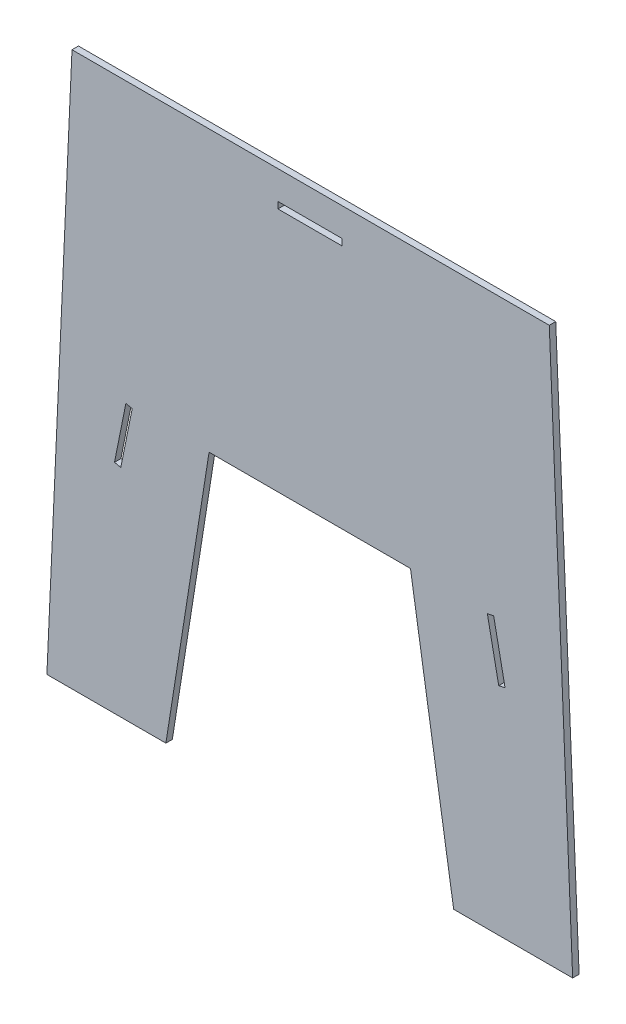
ISO-10303-21;
HEADER;
FILE_DESCRIPTION(('STEP AP214'),'2;1');
FILE_NAME('part.step','',(''),(''),'','','');
FILE_SCHEMA(('AUTOMOTIVE_DESIGN { 1 0 10303 214 1 1 1 1 }'));
ENDSEC;
DATA;
#1=APPLICATION_CONTEXT('core data for automotive mechanical design processes');
#2=APPLICATION_PROTOCOL_DEFINITION('international standard','automotive_design',2000,#1);
#3=PRODUCT_CONTEXT('',#1,'mechanical');
#4=PRODUCT('Part','Part','',(#3));
#5=PRODUCT_RELATED_PRODUCT_CATEGORY('part','',(#4));
#6=PRODUCT_DEFINITION_FORMATION('','',#4);
#7=PRODUCT_DEFINITION_CONTEXT('part definition',#1,'design');
#8=PRODUCT_DEFINITION('design','',#6,#7);
#9=PRODUCT_DEFINITION_SHAPE('','',#8);
#10=(LENGTH_UNIT() NAMED_UNIT(*) SI_UNIT(.MILLI.,.METRE.));
#11=(NAMED_UNIT(*) PLANE_ANGLE_UNIT() SI_UNIT($,.RADIAN.));
#12=(NAMED_UNIT(*) SI_UNIT($,.STERADIAN.) SOLID_ANGLE_UNIT());
#13=UNCERTAINTY_MEASURE_WITH_UNIT(LENGTH_MEASURE(1.E-05),#10,'distance_accuracy_value','');
#14=(GEOMETRIC_REPRESENTATION_CONTEXT(3) GLOBAL_UNCERTAINTY_ASSIGNED_CONTEXT((#13)) GLOBAL_UNIT_ASSIGNED_CONTEXT((#10,
#11,#12)) REPRESENTATION_CONTEXT('',''));
#15=CARTESIAN_POINT('',(0.,0.,0.));
#16=DIRECTION('',(0.,0.,1.));
#17=DIRECTION('',(1.,0.,0.));
#18=AXIS2_PLACEMENT_3D('',#15,#16,#17);
#19=CARTESIAN_POINT('',(0.,0.,1.524));
#20=DIRECTION('',(0.,0.,-1.));
#21=DIRECTION('',(-1.,0.,0.));
#22=AXIS2_PLACEMENT_3D('',#19,#20,#21);
#23=PLANE('',#22);
#24=DIRECTION('',(-0.197028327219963,0.980397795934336,0.));
#25=VECTOR('',#24,1.);
#26=CARTESIAN_POINT('',(43.3374292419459,52.9882041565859,1.524));
#27=LINE('',#26,#25);
#28=CARTESIAN_POINT('',(46.0269135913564,39.6055369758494,1.524));
#29=VERTEX_POINT('',#28);
#30=CARTESIAN_POINT('',(43.3374292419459,52.9882041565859,1.524));
#31=VERTEX_POINT('',#30);
#32=EDGE_CURVE('E207',#29,#31,#27,.T.);
#33=ORIENTED_EDGE('',*,*,#32,.F.);
#34=DIRECTION('',(0.980397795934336,0.197028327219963,0.));
#35=VECTOR('',#34,1.);
#36=CARTESIAN_POINT('',(46.0269135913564,39.6055369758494,1.524));
#37=LINE('',#36,#35);
#38=CARTESIAN_POINT('',(44.5327873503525,39.3052658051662,1.524));
#39=VERTEX_POINT('',#38);
#40=EDGE_CURVE('E215',#39,#29,#37,.T.);
#41=ORIENTED_EDGE('',*,*,#40,.F.);
#42=DIRECTION('',(0.197028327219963,-0.980397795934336,0.));
#43=VECTOR('',#42,1.);
#44=CARTESIAN_POINT('',(41.843303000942,52.6879329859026,1.524));
#45=LINE('',#44,#43);
#46=CARTESIAN_POINT('',(41.843303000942,52.6879329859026,1.524));
#47=VERTEX_POINT('',#46);
#48=EDGE_CURVE('E212',#47,#39,#45,.T.);
#49=ORIENTED_EDGE('',*,*,#48,.F.);
#50=DIRECTION('',(-0.980397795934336,-0.197028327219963,0.));
#51=VECTOR('',#50,1.);
#52=CARTESIAN_POINT('',(43.3374292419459,52.9882041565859,1.524));
#53=LINE('',#52,#51);
#54=EDGE_CURVE('E209',#31,#47,#53,.T.);
#55=ORIENTED_EDGE('',*,*,#54,.F.);
#56=EDGE_LOOP('',(#33,#41,#49,#55));
#57=FACE_BOUND('',#56,.T.);
#58=DIRECTION('',(1.,0.,0.));
#59=VECTOR('',#58,1.);
#60=CARTESIAN_POINT('',(-62.1420824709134,-11.745780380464,1.524));
#61=LINE('',#60,#59);
#62=CARTESIAN_POINT('',(-62.1420824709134,-11.745780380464,1.524));
#63=VERTEX_POINT('',#62);
#64=CARTESIAN_POINT('',(-34.0484267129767,-11.745780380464,1.524));
#65=VERTEX_POINT('',#64);
#66=EDGE_CURVE('E269',#63,#65,#61,.T.);
#67=ORIENTED_EDGE('',*,*,#66,.T.);
#68=DIRECTION('',(0.155946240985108,0.987765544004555,0.));
#69=VECTOR('',#68,1.);
#70=CARTESIAN_POINT('',(-23.8520713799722,52.8380685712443,1.524));
#71=LINE('',#70,#69);
#72=CARTESIAN_POINT('',(-23.8520713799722,52.8380685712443,1.524));
#73=VERTEX_POINT('',#72);
#74=EDGE_CURVE('E272',#65,#73,#71,.T.);
#75=ORIENTED_EDGE('',*,*,#74,.T.);
#76=DIRECTION('',(1.,0.,0.));
#77=VECTOR('',#76,1.);
#78=CARTESIAN_POINT('',(-23.8520713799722,52.8380685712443,1.524));
#79=LINE('',#78,#77);
#80=CARTESIAN_POINT('',(23.6958867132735,52.8380685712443,1.524));
#81=VERTEX_POINT('',#80);
#82=EDGE_CURVE('E275',#73,#81,#79,.T.);
#83=ORIENTED_EDGE('',*,*,#82,.T.);
#84=DIRECTION('',(0.155946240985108,-0.987765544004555,0.));
#85=VECTOR('',#84,1.);
#86=CARTESIAN_POINT('',(23.6958867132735,52.8380685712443,1.524));
#87=LINE('',#86,#85);
#88=CARTESIAN_POINT('',(33.8922420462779,-11.745780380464,1.524));
#89=VERTEX_POINT('',#88);
#90=EDGE_CURVE('E277',#81,#89,#87,.T.);
#91=ORIENTED_EDGE('',*,*,#90,.T.);
#92=DIRECTION('',(1.,0.,0.));
#93=VECTOR('',#92,1.);
#94=CARTESIAN_POINT('',(61.9858978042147,-11.745780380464,1.524));
#95=LINE('',#94,#93);
#96=CARTESIAN_POINT('',(61.9858978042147,-11.745780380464,1.524));
#97=VERTEX_POINT('',#96);
#98=EDGE_CURVE('E279',#89,#97,#95,.T.);
#99=ORIENTED_EDGE('',*,*,#98,.T.);
#100=DIRECTION('',(-0.0421941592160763,0.999109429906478,0.));
#101=VECTOR('',#100,1.);
#102=CARTESIAN_POINT('',(56.4665495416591,118.946073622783,1.524));
#103=LINE('',#102,#101);
#104=CARTESIAN_POINT('',(56.4665495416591,118.946073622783,1.524));
#105=VERTEX_POINT('',#104);
#106=EDGE_CURVE('E281',#97,#105,#103,.T.);
#107=ORIENTED_EDGE('',*,*,#106,.T.);
#108=DIRECTION('',(-1.,0.,0.));
#109=VECTOR('',#108,1.);
#110=CARTESIAN_POINT('',(-56.2129587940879,118.946073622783,1.524));
#111=LINE('',#110,#109);
#112=CARTESIAN_POINT('',(-56.2129587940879,118.946073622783,1.524));
#113=VERTEX_POINT('',#112);
#114=EDGE_CURVE('E283',#105,#113,#111,.T.);
#115=ORIENTED_EDGE('',*,*,#114,.T.);
#116=DIRECTION('',(-0.0453205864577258,-0.998972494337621,0.));
#117=VECTOR('',#116,1.);
#118=CARTESIAN_POINT('',(-62.1420824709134,-11.745780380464,1.524));
#119=LINE('',#118,#117);
#120=EDGE_CURVE('E285',#113,#63,#119,.T.);
#121=ORIENTED_EDGE('',*,*,#120,.T.);
#122=EDGE_LOOP('',(#67,#75,#83,#91,#99,#107,#115,#121));
#123=FACE_BOUND('',#122,.T.);
#124=DIRECTION('',(0.,1.,0.));
#125=VECTOR('',#124,1.);
#126=CARTESIAN_POINT('',(7.56016827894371,110.706807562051,1.524));
#127=LINE('',#126,#125);
#128=CARTESIAN_POINT('',(7.56016827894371,110.706807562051,1.524));
#129=VERTEX_POINT('',#128);
#130=CARTESIAN_POINT('',(7.56016827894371,112.230807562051,1.524));
#131=VERTEX_POINT('',#130);
#132=EDGE_CURVE('E238',#129,#131,#127,.T.);
#133=ORIENTED_EDGE('',*,*,#132,.F.);
#134=DIRECTION('',(1.,0.,0.));
#135=VECTOR('',#134,1.);
#136=CARTESIAN_POINT('',(-7.59699248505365,110.706807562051,1.524));
#137=LINE('',#136,#135);
#138=CARTESIAN_POINT('',(-7.59699248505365,110.706807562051,1.524));
#139=VERTEX_POINT('',#138);
#140=EDGE_CURVE('E246',#139,#129,#137,.T.);
#141=ORIENTED_EDGE('',*,*,#140,.F.);
#142=DIRECTION('',(0.,-1.,0.));
#143=VECTOR('',#142,1.);
#144=CARTESIAN_POINT('',(-7.59699248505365,110.706807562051,1.524));
#145=LINE('',#144,#143);
#146=CARTESIAN_POINT('',(-7.59699248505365,112.230807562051,1.524));
#147=VERTEX_POINT('',#146);
#148=EDGE_CURVE('E243',#147,#139,#145,.T.);
#149=ORIENTED_EDGE('',*,*,#148,.F.);
#150=DIRECTION('',(-1.,0.,0.));
#151=VECTOR('',#150,1.);
#152=CARTESIAN_POINT('',(-7.59699248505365,112.230807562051,1.524));
#153=LINE('',#152,#151);
#154=EDGE_CURVE('E240',#131,#147,#153,.T.);
#155=ORIENTED_EDGE('',*,*,#154,.F.);
#156=EDGE_LOOP('',(#133,#141,#149,#155));
#157=FACE_BOUND('',#156,.T.);
#158=DIRECTION('',(-0.980397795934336,0.197028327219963,0.));
#159=VECTOR('',#158,1.);
#160=CARTESIAN_POINT('',(-43.4936139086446,52.9882041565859,1.524));
#161=LINE('',#160,#159);
#162=CARTESIAN_POINT('',(-41.9994876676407,52.6879329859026,1.524));
#163=VERTEX_POINT('',#162);
#164=CARTESIAN_POINT('',(-43.4936139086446,52.9882041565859,1.524));
#165=VERTEX_POINT('',#164);
#166=EDGE_CURVE('E171',#163,#165,#161,.T.);
#167=ORIENTED_EDGE('',*,*,#166,.F.);
#168=DIRECTION('',(0.197028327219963,0.980397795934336,0.));
#169=VECTOR('',#168,1.);
#170=CARTESIAN_POINT('',(-41.9994876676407,52.6879329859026,1.524));
#171=LINE('',#170,#169);
#172=CARTESIAN_POINT('',(-44.6889720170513,39.3052658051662,1.524));
#173=VERTEX_POINT('',#172);
#174=EDGE_CURVE('E193',#173,#163,#171,.T.);
#175=ORIENTED_EDGE('',*,*,#174,.F.);
#176=DIRECTION('',(0.980397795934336,-0.197028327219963,0.));
#177=VECTOR('',#176,1.);
#178=CARTESIAN_POINT('',(-46.1830982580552,39.6055369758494,1.524));
#179=LINE('',#178,#177);
#180=CARTESIAN_POINT('',(-46.1830982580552,39.6055369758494,1.524));
#181=VERTEX_POINT('',#180);
#182=EDGE_CURVE('E191',#181,#173,#179,.T.);
#183=ORIENTED_EDGE('',*,*,#182,.F.);
#184=DIRECTION('',(-0.197028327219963,-0.980397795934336,0.));
#185=VECTOR('',#184,1.);
#186=CARTESIAN_POINT('',(-43.4936139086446,52.9882041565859,1.524));
#187=LINE('',#186,#185);
#188=EDGE_CURVE('E179',#165,#181,#187,.T.);
#189=ORIENTED_EDGE('',*,*,#188,.F.);
#190=EDGE_LOOP('',(#167,#175,#183,#189));
#191=FACE_BOUND('',#190,.T.);
#192=ADVANCED_FACE('F34',(#57,#123,#157,#191),#23,.F.);
#193=CARTESIAN_POINT('',(0.,0.,0.));
#194=DIRECTION('',(0.,0.,-1.));
#195=DIRECTION('',(-1.,0.,0.));
#196=AXIS2_PLACEMENT_3D('',#193,#194,#195);
#197=PLANE('',#196);
#198=DIRECTION('',(0.980397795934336,0.197028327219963,0.));
#199=VECTOR('',#198,1.);
#200=CARTESIAN_POINT('',(46.0269135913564,39.6055369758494,0.));
#201=LINE('',#200,#199);
#202=CARTESIAN_POINT('',(44.5327873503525,39.3052658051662,0.));
#203=VERTEX_POINT('',#202);
#204=CARTESIAN_POINT('',(46.0269135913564,39.6055369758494,0.));
#205=VERTEX_POINT('',#204);
#206=EDGE_CURVE('E210',#203,#205,#201,.T.);
#207=ORIENTED_EDGE('',*,*,#206,.T.);
#208=DIRECTION('',(-0.197028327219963,0.980397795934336,0.));
#209=VECTOR('',#208,1.);
#210=CARTESIAN_POINT('',(43.3374292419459,52.9882041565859,0.));
#211=LINE('',#210,#209);
#212=CARTESIAN_POINT('',(43.3374292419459,52.9882041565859,0.));
#213=VERTEX_POINT('',#212);
#214=EDGE_CURVE('E187',#205,#213,#211,.T.);
#215=ORIENTED_EDGE('',*,*,#214,.T.);
#216=DIRECTION('',(-0.980397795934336,-0.197028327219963,0.));
#217=VECTOR('',#216,1.);
#218=CARTESIAN_POINT('',(43.3374292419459,52.9882041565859,0.));
#219=LINE('',#218,#217);
#220=CARTESIAN_POINT('',(41.843303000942,52.6879329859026,0.));
#221=VERTEX_POINT('',#220);
#222=EDGE_CURVE('E220',#213,#221,#219,.T.);
#223=ORIENTED_EDGE('',*,*,#222,.T.);
#224=DIRECTION('',(0.197028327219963,-0.980397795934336,0.));
#225=VECTOR('',#224,1.);
#226=CARTESIAN_POINT('',(41.843303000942,52.6879329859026,0.));
#227=LINE('',#226,#225);
#228=EDGE_CURVE('E223',#221,#203,#227,.T.);
#229=ORIENTED_EDGE('',*,*,#228,.T.);
#230=EDGE_LOOP('',(#207,#215,#223,#229));
#231=FACE_BOUND('',#230,.T.);
#232=DIRECTION('',(1.,0.,0.));
#233=VECTOR('',#232,1.);
#234=CARTESIAN_POINT('',(-62.1420824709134,-11.745780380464,0.));
#235=LINE('',#234,#233);
#236=CARTESIAN_POINT('',(-62.1420824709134,-11.745780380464,0.));
#237=VERTEX_POINT('',#236);
#238=CARTESIAN_POINT('',(-34.0484267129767,-11.745780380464,0.));
#239=VERTEX_POINT('',#238);
#240=EDGE_CURVE('E268',#237,#239,#235,.T.);
#241=ORIENTED_EDGE('',*,*,#240,.F.);
#242=DIRECTION('',(-0.0453205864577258,-0.998972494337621,0.));
#243=VECTOR('',#242,1.);
#244=CARTESIAN_POINT('',(-62.1420824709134,-11.745780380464,0.));
#245=LINE('',#244,#243);
#246=CARTESIAN_POINT('',(-56.2129587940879,118.946073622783,0.));
#247=VERTEX_POINT('',#246);
#248=EDGE_CURVE('E273',#247,#237,#245,.T.);
#249=ORIENTED_EDGE('',*,*,#248,.F.);
#250=DIRECTION('',(-1.,0.,0.));
#251=VECTOR('',#250,1.);
#252=CARTESIAN_POINT('',(-56.2129587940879,118.946073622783,0.));
#253=LINE('',#252,#251);
#254=CARTESIAN_POINT('',(56.4665495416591,118.946073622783,0.));
#255=VERTEX_POINT('',#254);
#256=EDGE_CURVE('E300',#255,#247,#253,.T.);
#257=ORIENTED_EDGE('',*,*,#256,.F.);
#258=DIRECTION('',(-0.0421941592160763,0.999109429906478,0.));
#259=VECTOR('',#258,1.);
#260=CARTESIAN_POINT('',(56.4665495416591,118.946073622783,0.));
#261=LINE('',#260,#259);
#262=CARTESIAN_POINT('',(61.9858978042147,-11.745780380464,0.));
#263=VERTEX_POINT('',#262);
#264=EDGE_CURVE('E298',#263,#255,#261,.T.);
#265=ORIENTED_EDGE('',*,*,#264,.F.);
#266=DIRECTION('',(1.,0.,0.));
#267=VECTOR('',#266,1.);
#268=CARTESIAN_POINT('',(61.9858978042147,-11.745780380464,0.));
#269=LINE('',#268,#267);
#270=CARTESIAN_POINT('',(33.8922420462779,-11.745780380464,0.));
#271=VERTEX_POINT('',#270);
#272=EDGE_CURVE('E296',#271,#263,#269,.T.);
#273=ORIENTED_EDGE('',*,*,#272,.F.);
#274=DIRECTION('',(0.155946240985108,-0.987765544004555,0.));
#275=VECTOR('',#274,1.);
#276=CARTESIAN_POINT('',(23.6958867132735,52.8380685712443,0.));
#277=LINE('',#276,#275);
#278=CARTESIAN_POINT('',(23.6958867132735,52.8380685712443,0.));
#279=VERTEX_POINT('',#278);
#280=EDGE_CURVE('E294',#279,#271,#277,.T.);
#281=ORIENTED_EDGE('',*,*,#280,.F.);
#282=DIRECTION('',(1.,0.,0.));
#283=VECTOR('',#282,1.);
#284=CARTESIAN_POINT('',(-23.8520713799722,52.8380685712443,0.));
#285=LINE('',#284,#283);
#286=CARTESIAN_POINT('',(-23.8520713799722,52.8380685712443,0.));
#287=VERTEX_POINT('',#286);
#288=EDGE_CURVE('E292',#287,#279,#285,.T.);
#289=ORIENTED_EDGE('',*,*,#288,.F.);
#290=DIRECTION('',(0.155946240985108,0.987765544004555,0.));
#291=VECTOR('',#290,1.);
#292=CARTESIAN_POINT('',(-23.8520713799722,52.8380685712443,0.));
#293=LINE('',#292,#291);
#294=EDGE_CURVE('E290',#239,#287,#293,.T.);
#295=ORIENTED_EDGE('',*,*,#294,.F.);
#296=EDGE_LOOP('',(#241,#249,#257,#265,#273,#281,#289,#295));
#297=FACE_BOUND('',#296,.T.);
#298=DIRECTION('',(1.,0.,0.));
#299=VECTOR('',#298,1.);
#300=CARTESIAN_POINT('',(-7.59699248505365,110.706807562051,0.));
#301=LINE('',#300,#299);
#302=CARTESIAN_POINT('',(-7.59699248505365,110.706807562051,0.));
#303=VERTEX_POINT('',#302);
#304=CARTESIAN_POINT('',(7.56016827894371,110.706807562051,0.));
#305=VERTEX_POINT('',#304);
#306=EDGE_CURVE('E241',#303,#305,#301,.T.);
#307=ORIENTED_EDGE('',*,*,#306,.T.);
#308=DIRECTION('',(0.,1.,0.));
#309=VECTOR('',#308,1.);
#310=CARTESIAN_POINT('',(7.56016827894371,110.706807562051,0.));
#311=LINE('',#310,#309);
#312=CARTESIAN_POINT('',(7.56016827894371,112.230807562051,0.));
#313=VERTEX_POINT('',#312);
#314=EDGE_CURVE('E237',#305,#313,#311,.T.);
#315=ORIENTED_EDGE('',*,*,#314,.T.);
#316=DIRECTION('',(-1.,0.,0.));
#317=VECTOR('',#316,1.);
#318=CARTESIAN_POINT('',(-7.59699248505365,112.230807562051,0.));
#319=LINE('',#318,#317);
#320=CARTESIAN_POINT('',(-7.59699248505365,112.230807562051,0.));
#321=VERTEX_POINT('',#320);
#322=EDGE_CURVE('E251',#313,#321,#319,.T.);
#323=ORIENTED_EDGE('',*,*,#322,.T.);
#324=DIRECTION('',(0.,-1.,0.));
#325=VECTOR('',#324,1.);
#326=CARTESIAN_POINT('',(-7.59699248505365,110.706807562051,0.));
#327=LINE('',#326,#325);
#328=EDGE_CURVE('E254',#321,#303,#327,.T.);
#329=ORIENTED_EDGE('',*,*,#328,.T.);
#330=EDGE_LOOP('',(#307,#315,#323,#329));
#331=FACE_BOUND('',#330,.T.);
#332=DIRECTION('',(0.197028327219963,0.980397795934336,0.));
#333=VECTOR('',#332,1.);
#334=CARTESIAN_POINT('',(-41.9994876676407,52.6879329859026,0.));
#335=LINE('',#334,#333);
#336=CARTESIAN_POINT('',(-44.6889720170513,39.3052658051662,0.));
#337=VERTEX_POINT('',#336);
#338=CARTESIAN_POINT('',(-41.9994876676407,52.6879329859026,0.));
#339=VERTEX_POINT('',#338);
#340=EDGE_CURVE('E180',#337,#339,#335,.T.);
#341=ORIENTED_EDGE('',*,*,#340,.T.);
#342=DIRECTION('',(-0.980397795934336,0.197028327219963,0.));
#343=VECTOR('',#342,1.);
#344=CARTESIAN_POINT('',(-43.4936139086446,52.9882041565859,0.));
#345=LINE('',#344,#343);
#346=CARTESIAN_POINT('',(-43.4936139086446,52.9882041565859,0.));
#347=VERTEX_POINT('',#346);
#348=EDGE_CURVE('E57',#339,#347,#345,.T.);
#349=ORIENTED_EDGE('',*,*,#348,.T.);
#350=DIRECTION('',(-0.197028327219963,-0.980397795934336,0.));
#351=VECTOR('',#350,1.);
#352=CARTESIAN_POINT('',(-43.4936139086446,52.9882041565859,0.));
#353=LINE('',#352,#351);
#354=CARTESIAN_POINT('',(-46.1830982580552,39.6055369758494,0.));
#355=VERTEX_POINT('',#354);
#356=EDGE_CURVE('E186',#347,#355,#353,.T.);
#357=ORIENTED_EDGE('',*,*,#356,.T.);
#358=DIRECTION('',(0.980397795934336,-0.197028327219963,0.));
#359=VECTOR('',#358,1.);
#360=CARTESIAN_POINT('',(-46.1830982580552,39.6055369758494,0.));
#361=LINE('',#360,#359);
#362=EDGE_CURVE('E199',#355,#337,#361,.T.);
#363=ORIENTED_EDGE('',*,*,#362,.T.);
#364=EDGE_LOOP('',(#341,#349,#357,#363));
#365=FACE_BOUND('',#364,.T.);
#366=ADVANCED_FACE('F330',(#231,#297,#331,#365),#197,.T.);
#367=CARTESIAN_POINT('',(-62.1420824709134,-11.745780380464,1.524));
#368=DIRECTION('',(0.,1.,0.));
#369=DIRECTION('',(0.,0.,1.));
#370=AXIS2_PLACEMENT_3D('',#367,#368,#369);
#371=PLANE('',#370);
#372=ORIENTED_EDGE('',*,*,#240,.T.);
#373=DIRECTION('',(0.,0.,-1.));
#374=VECTOR('',#373,1.);
#375=CARTESIAN_POINT('',(-34.0484267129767,-11.745780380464,1.524));
#376=LINE('',#375,#374);
#377=EDGE_CURVE('E11',#65,#239,#376,.T.);
#378=ORIENTED_EDGE('',*,*,#377,.F.);
#379=ORIENTED_EDGE('',*,*,#66,.F.);
#380=DIRECTION('',(0.,0.,-1.));
#381=VECTOR('',#380,1.);
#382=CARTESIAN_POINT('',(-62.1420824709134,-11.745780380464,1.524));
#383=LINE('',#382,#381);
#384=EDGE_CURVE('E287',#63,#237,#383,.T.);
#385=ORIENTED_EDGE('',*,*,#384,.T.);
#386=EDGE_LOOP('',(#372,#378,#379,#385));
#387=FACE_BOUND('',#386,.T.);
#388=ADVANCED_FACE('F36',(#387),#371,.F.);
#389=CARTESIAN_POINT('',(-23.8520713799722,52.8380685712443,1.524));
#390=DIRECTION('',(-0.987765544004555,0.155946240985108,0.));
#391=DIRECTION('',(-0.155946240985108,-0.987765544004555,0.));
#392=AXIS2_PLACEMENT_3D('',#389,#390,#391);
#393=PLANE('',#392);
#394=ORIENTED_EDGE('',*,*,#294,.T.);
#395=DIRECTION('',(0.,0.,-1.));
#396=VECTOR('',#395,1.);
#397=CARTESIAN_POINT('',(-23.8520713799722,52.8380685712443,1.524));
#398=LINE('',#397,#396);
#399=EDGE_CURVE('E42',#73,#287,#398,.T.);
#400=ORIENTED_EDGE('',*,*,#399,.F.);
#401=ORIENTED_EDGE('',*,*,#74,.F.);
#402=ORIENTED_EDGE('',*,*,#377,.T.);
#403=EDGE_LOOP('',(#394,#400,#401,#402));
#404=FACE_BOUND('',#403,.T.);
#405=ADVANCED_FACE('F348',(#404),#393,.F.);
#406=CARTESIAN_POINT('',(-23.8520713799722,52.8380685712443,1.524));
#407=DIRECTION('',(0.,1.,0.));
#408=DIRECTION('',(0.,0.,1.));
#409=AXIS2_PLACEMENT_3D('',#406,#407,#408);
#410=PLANE('',#409);
#411=ORIENTED_EDGE('',*,*,#288,.T.);
#412=DIRECTION('',(0.,0.,-1.));
#413=VECTOR('',#412,1.);
#414=CARTESIAN_POINT('',(23.6958867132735,52.8380685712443,1.524));
#415=LINE('',#414,#413);
#416=EDGE_CURVE('E317',#81,#279,#415,.T.);
#417=ORIENTED_EDGE('',*,*,#416,.F.);
#418=ORIENTED_EDGE('',*,*,#82,.F.);
#419=ORIENTED_EDGE('',*,*,#399,.T.);
#420=EDGE_LOOP('',(#411,#417,#418,#419));
#421=FACE_BOUND('',#420,.T.);
#422=ADVANCED_FACE('F324',(#421),#410,.F.);
#423=CARTESIAN_POINT('',(23.6958867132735,52.8380685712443,1.524));
#424=DIRECTION('',(0.987765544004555,0.155946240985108,0.));
#425=DIRECTION('',(-0.155946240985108,0.987765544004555,0.));
#426=AXIS2_PLACEMENT_3D('',#423,#424,#425);
#427=PLANE('',#426);
#428=ORIENTED_EDGE('',*,*,#280,.T.);
#429=DIRECTION('',(0.,0.,-1.));
#430=VECTOR('',#429,1.);
#431=CARTESIAN_POINT('',(33.8922420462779,-11.745780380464,1.524));
#432=LINE('',#431,#430);
#433=EDGE_CURVE('E314',#89,#271,#432,.T.);
#434=ORIENTED_EDGE('',*,*,#433,.F.);
#435=ORIENTED_EDGE('',*,*,#90,.F.);
#436=ORIENTED_EDGE('',*,*,#416,.T.);
#437=EDGE_LOOP('',(#428,#434,#435,#436));
#438=FACE_BOUND('',#437,.T.);
#439=ADVANCED_FACE('F336',(#438),#427,.F.);
#440=CARTESIAN_POINT('',(61.9858978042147,-11.745780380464,1.524));
#441=DIRECTION('',(0.,1.,0.));
#442=DIRECTION('',(0.,0.,1.));
#443=AXIS2_PLACEMENT_3D('',#440,#441,#442);
#444=PLANE('',#443);
#445=ORIENTED_EDGE('',*,*,#272,.T.);
#446=DIRECTION('',(0.,0.,-1.));
#447=VECTOR('',#446,1.);
#448=CARTESIAN_POINT('',(61.9858978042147,-11.745780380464,1.524));
#449=LINE('',#448,#447);
#450=EDGE_CURVE('E311',#97,#263,#449,.T.);
#451=ORIENTED_EDGE('',*,*,#450,.F.);
#452=ORIENTED_EDGE('',*,*,#98,.F.);
#453=ORIENTED_EDGE('',*,*,#433,.T.);
#454=EDGE_LOOP('',(#445,#451,#452,#453));
#455=FACE_BOUND('',#454,.T.);
#456=ADVANCED_FACE('F340',(#455),#444,.F.);
#457=CARTESIAN_POINT('',(56.4665495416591,118.946073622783,1.524));
#458=DIRECTION('',(-0.999109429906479,-0.0421941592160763,0.));
#459=DIRECTION('',(0.0421941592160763,-0.999109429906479,0.));
#460=AXIS2_PLACEMENT_3D('',#457,#458,#459);
#461=PLANE('',#460);
#462=ORIENTED_EDGE('',*,*,#264,.T.);
#463=DIRECTION('',(0.,0.,-1.));
#464=VECTOR('',#463,1.);
#465=CARTESIAN_POINT('',(56.4665495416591,118.946073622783,1.524));
#466=LINE('',#465,#464);
#467=EDGE_CURVE('E308',#105,#255,#466,.T.);
#468=ORIENTED_EDGE('',*,*,#467,.F.);
#469=ORIENTED_EDGE('',*,*,#106,.F.);
#470=ORIENTED_EDGE('',*,*,#450,.T.);
#471=EDGE_LOOP('',(#462,#468,#469,#470));
#472=FACE_BOUND('',#471,.T.);
#473=ADVANCED_FACE('F361',(#472),#461,.F.);
#474=CARTESIAN_POINT('',(-56.2129587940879,118.946073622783,1.524));
#475=DIRECTION('',(0.,-1.,0.));
#476=DIRECTION('',(1.,0.,0.));
#477=AXIS2_PLACEMENT_3D('',#474,#475,#476);
#478=PLANE('',#477);
#479=ORIENTED_EDGE('',*,*,#256,.T.);
#480=DIRECTION('',(0.,0.,-1.));
#481=VECTOR('',#480,1.);
#482=CARTESIAN_POINT('',(-56.2129587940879,118.946073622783,1.524));
#483=LINE('',#482,#481);
#484=EDGE_CURVE('E305',#113,#247,#483,.T.);
#485=ORIENTED_EDGE('',*,*,#484,.F.);
#486=ORIENTED_EDGE('',*,*,#114,.F.);
#487=ORIENTED_EDGE('',*,*,#467,.T.);
#488=EDGE_LOOP('',(#479,#485,#486,#487));
#489=FACE_BOUND('',#488,.T.);
#490=ADVANCED_FACE('F359',(#489),#478,.F.);
#491=CARTESIAN_POINT('',(-62.1420824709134,-11.745780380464,1.524));
#492=DIRECTION('',(0.998972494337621,-0.0453205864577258,0.));
#493=DIRECTION('',(0.0453205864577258,0.998972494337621,0.));
#494=AXIS2_PLACEMENT_3D('',#491,#492,#493);
#495=PLANE('',#494);
#496=ORIENTED_EDGE('',*,*,#248,.T.);
#497=ORIENTED_EDGE('',*,*,#384,.F.);
#498=ORIENTED_EDGE('',*,*,#120,.F.);
#499=ORIENTED_EDGE('',*,*,#484,.T.);
#500=EDGE_LOOP('',(#496,#497,#498,#499));
#501=FACE_BOUND('',#500,.T.);
#502=ADVANCED_FACE('F354',(#501),#495,.F.);
#503=CARTESIAN_POINT('',(7.56016827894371,110.706807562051,1.524));
#504=DIRECTION('',(-1.,0.,0.));
#505=DIRECTION('',(0.,0.,1.));
#506=AXIS2_PLACEMENT_3D('',#503,#504,#505);
#507=PLANE('',#506);
#508=ORIENTED_EDGE('',*,*,#314,.F.);
#509=DIRECTION('',(0.,0.,-1.));
#510=VECTOR('',#509,1.);
#511=CARTESIAN_POINT('',(7.56016827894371,110.706807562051,1.524));
#512=LINE('',#511,#510);
#513=EDGE_CURVE('E248',#129,#305,#512,.T.);
#514=ORIENTED_EDGE('',*,*,#513,.F.);
#515=ORIENTED_EDGE('',*,*,#132,.T.);
#516=DIRECTION('',(0.,0.,-1.));
#517=VECTOR('',#516,1.);
#518=CARTESIAN_POINT('',(7.56016827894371,112.230807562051,1.524));
#519=LINE('',#518,#517);
#520=EDGE_CURVE('E265',#131,#313,#519,.T.);
#521=ORIENTED_EDGE('',*,*,#520,.T.);
#522=EDGE_LOOP('',(#508,#514,#515,#521));
#523=FACE_BOUND('',#522,.T.);
#524=ADVANCED_FACE('F380',(#523),#507,.T.);
#525=CARTESIAN_POINT('',(-7.59699248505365,112.230807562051,1.524));
#526=DIRECTION('',(0.,-1.,0.));
#527=DIRECTION('',(0.,0.,-1.));
#528=AXIS2_PLACEMENT_3D('',#525,#526,#527);
#529=PLANE('',#528);
#530=ORIENTED_EDGE('',*,*,#322,.F.);
#531=ORIENTED_EDGE('',*,*,#520,.F.);
#532=ORIENTED_EDGE('',*,*,#154,.T.);
#533=DIRECTION('',(0.,0.,-1.));
#534=VECTOR('',#533,1.);
#535=CARTESIAN_POINT('',(-7.59699248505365,112.230807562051,1.524));
#536=LINE('',#535,#534);
#537=EDGE_CURVE('E263',#147,#321,#536,.T.);
#538=ORIENTED_EDGE('',*,*,#537,.T.);
#539=EDGE_LOOP('',(#530,#531,#532,#538));
#540=FACE_BOUND('',#539,.T.);
#541=ADVANCED_FACE('F387',(#540),#529,.T.);
#542=CARTESIAN_POINT('',(-7.59699248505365,110.706807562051,1.524));
#543=DIRECTION('',(1.,0.,0.));
#544=DIRECTION('',(0.,0.,-1.));
#545=AXIS2_PLACEMENT_3D('',#542,#543,#544);
#546=PLANE('',#545);
#547=ORIENTED_EDGE('',*,*,#328,.F.);
#548=ORIENTED_EDGE('',*,*,#537,.F.);
#549=ORIENTED_EDGE('',*,*,#148,.T.);
#550=DIRECTION('',(0.,0.,-1.));
#551=VECTOR('',#550,1.);
#552=CARTESIAN_POINT('',(-7.59699248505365,110.706807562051,1.524));
#553=LINE('',#552,#551);
#554=EDGE_CURVE('E261',#139,#303,#553,.T.);
#555=ORIENTED_EDGE('',*,*,#554,.T.);
#556=EDGE_LOOP('',(#547,#548,#549,#555));
#557=FACE_BOUND('',#556,.T.);
#558=ADVANCED_FACE('F392',(#557),#546,.T.);
#559=CARTESIAN_POINT('',(-7.59699248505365,110.706807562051,1.524));
#560=DIRECTION('',(0.,1.,0.));
#561=DIRECTION('',(0.,0.,1.));
#562=AXIS2_PLACEMENT_3D('',#559,#560,#561);
#563=PLANE('',#562);
#564=ORIENTED_EDGE('',*,*,#306,.F.);
#565=ORIENTED_EDGE('',*,*,#554,.F.);
#566=ORIENTED_EDGE('',*,*,#140,.T.);
#567=ORIENTED_EDGE('',*,*,#513,.T.);
#568=EDGE_LOOP('',(#564,#565,#566,#567));
#569=FACE_BOUND('',#568,.T.);
#570=ADVANCED_FACE('F399',(#569),#563,.T.);
#571=CARTESIAN_POINT('',(43.3374292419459,52.9882041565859,1.524));
#572=DIRECTION('',(-0.980397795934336,-0.197028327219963,0.));
#573=DIRECTION('',(0.197028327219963,-0.980397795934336,0.));
#574=AXIS2_PLACEMENT_3D('',#571,#572,#573);
#575=PLANE('',#574);
#576=ORIENTED_EDGE('',*,*,#214,.F.);
#577=DIRECTION('',(0.,0.,-1.));
#578=VECTOR('',#577,1.);
#579=CARTESIAN_POINT('',(46.0269135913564,39.6055369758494,1.524));
#580=LINE('',#579,#578);
#581=EDGE_CURVE('E217',#29,#205,#580,.T.);
#582=ORIENTED_EDGE('',*,*,#581,.F.);
#583=ORIENTED_EDGE('',*,*,#32,.T.);
#584=DIRECTION('',(0.,0.,-1.));
#585=VECTOR('',#584,1.);
#586=CARTESIAN_POINT('',(43.3374292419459,52.9882041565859,1.524));
#587=LINE('',#586,#585);
#588=EDGE_CURVE('E234',#31,#213,#587,.T.);
#589=ORIENTED_EDGE('',*,*,#588,.T.);
#590=EDGE_LOOP('',(#576,#582,#583,#589));
#591=FACE_BOUND('',#590,.T.);
#592=ADVANCED_FACE('F412',(#591),#575,.T.);
#593=CARTESIAN_POINT('',(43.3374292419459,52.9882041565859,1.524));
#594=DIRECTION('',(0.197028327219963,-0.980397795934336,0.));
#595=DIRECTION('',(0.980397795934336,0.197028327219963,0.));
#596=AXIS2_PLACEMENT_3D('',#593,#594,#595);
#597=PLANE('',#596);
#598=ORIENTED_EDGE('',*,*,#222,.F.);
#599=ORIENTED_EDGE('',*,*,#588,.F.);
#600=ORIENTED_EDGE('',*,*,#54,.T.);
#601=DIRECTION('',(0.,0.,-1.));
#602=VECTOR('',#601,1.);
#603=CARTESIAN_POINT('',(41.843303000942,52.6879329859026,1.524));
#604=LINE('',#603,#602);
#605=EDGE_CURVE('E232',#47,#221,#604,.T.);
#606=ORIENTED_EDGE('',*,*,#605,.T.);
#607=EDGE_LOOP('',(#598,#599,#600,#606));
#608=FACE_BOUND('',#607,.T.);
#609=ADVANCED_FACE('F417',(#608),#597,.T.);
#610=CARTESIAN_POINT('',(41.843303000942,52.6879329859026,1.524));
#611=DIRECTION('',(0.980397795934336,0.197028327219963,0.));
#612=DIRECTION('',(-0.197028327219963,0.980397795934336,0.));
#613=AXIS2_PLACEMENT_3D('',#610,#611,#612);
#614=PLANE('',#613);
#615=ORIENTED_EDGE('',*,*,#228,.F.);
#616=ORIENTED_EDGE('',*,*,#605,.F.);
#617=ORIENTED_EDGE('',*,*,#48,.T.);
#618=DIRECTION('',(0.,0.,-1.));
#619=VECTOR('',#618,1.);
#620=CARTESIAN_POINT('',(44.5327873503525,39.3052658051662,1.524));
#621=LINE('',#620,#619);
#622=EDGE_CURVE('E230',#39,#203,#621,.T.);
#623=ORIENTED_EDGE('',*,*,#622,.T.);
#624=EDGE_LOOP('',(#615,#616,#617,#623));
#625=FACE_BOUND('',#624,.T.);
#626=ADVANCED_FACE('F421',(#625),#614,.T.);
#627=CARTESIAN_POINT('',(46.0269135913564,39.6055369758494,1.524));
#628=DIRECTION('',(-0.197028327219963,0.980397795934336,0.));
#629=DIRECTION('',(-0.980397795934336,-0.197028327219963,0.));
#630=AXIS2_PLACEMENT_3D('',#627,#628,#629);
#631=PLANE('',#630);
#632=ORIENTED_EDGE('',*,*,#206,.F.);
#633=ORIENTED_EDGE('',*,*,#622,.F.);
#634=ORIENTED_EDGE('',*,*,#40,.T.);
#635=ORIENTED_EDGE('',*,*,#581,.T.);
#636=EDGE_LOOP('',(#632,#633,#634,#635));
#637=FACE_BOUND('',#636,.T.);
#638=ADVANCED_FACE('F425',(#637),#631,.T.);
#639=CARTESIAN_POINT('',(-43.4936139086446,52.9882041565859,1.524));
#640=DIRECTION('',(-0.197028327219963,-0.980397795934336,0.));
#641=DIRECTION('',(0.980397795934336,-0.197028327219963,0.));
#642=AXIS2_PLACEMENT_3D('',#639,#640,#641);
#643=PLANE('',#642);
#644=ORIENTED_EDGE('',*,*,#348,.F.);
#645=DIRECTION('',(0.,0.,-1.));
#646=VECTOR('',#645,1.);
#647=CARTESIAN_POINT('',(-41.9994876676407,52.6879329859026,1.524));
#648=LINE('',#647,#646);
#649=EDGE_CURVE('E175',#163,#339,#648,.T.);
#650=ORIENTED_EDGE('',*,*,#649,.F.);
#651=ORIENTED_EDGE('',*,*,#166,.T.);
#652=DIRECTION('',(0.,0.,-1.));
#653=VECTOR('',#652,1.);
#654=CARTESIAN_POINT('',(-43.4936139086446,52.9882041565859,1.524));
#655=LINE('',#654,#653);
#656=EDGE_CURVE('E174',#165,#347,#655,.T.);
#657=ORIENTED_EDGE('',*,*,#656,.T.);
#658=EDGE_LOOP('',(#644,#650,#651,#657));
#659=FACE_BOUND('',#658,.T.);
#660=ADVANCED_FACE('F173',(#659),#643,.T.);
#661=CARTESIAN_POINT('',(-43.4936139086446,52.9882041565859,1.524));
#662=DIRECTION('',(0.980397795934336,-0.197028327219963,0.));
#663=DIRECTION('',(0.197028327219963,0.980397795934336,0.));
#664=AXIS2_PLACEMENT_3D('',#661,#662,#663);
#665=PLANE('',#664);
#666=ORIENTED_EDGE('',*,*,#356,.F.);
#667=ORIENTED_EDGE('',*,*,#656,.F.);
#668=ORIENTED_EDGE('',*,*,#188,.T.);
#669=DIRECTION('',(0.,0.,-1.));
#670=VECTOR('',#669,1.);
#671=CARTESIAN_POINT('',(-46.1830982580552,39.6055369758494,1.524));
#672=LINE('',#671,#670);
#673=EDGE_CURVE('E188',#181,#355,#672,.T.);
#674=ORIENTED_EDGE('',*,*,#673,.T.);
#675=EDGE_LOOP('',(#666,#667,#668,#674));
#676=FACE_BOUND('',#675,.T.);
#677=ADVANCED_FACE('F183',(#676),#665,.T.);
#678=CARTESIAN_POINT('',(-46.1830982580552,39.6055369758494,1.524));
#679=DIRECTION('',(0.197028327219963,0.980397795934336,0.));
#680=DIRECTION('',(-0.980397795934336,0.197028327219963,0.));
#681=AXIS2_PLACEMENT_3D('',#678,#679,#680);
#682=PLANE('',#681);
#683=ORIENTED_EDGE('',*,*,#362,.F.);
#684=ORIENTED_EDGE('',*,*,#673,.F.);
#685=ORIENTED_EDGE('',*,*,#182,.T.);
#686=DIRECTION('',(0.,0.,-1.));
#687=VECTOR('',#686,1.);
#688=CARTESIAN_POINT('',(-44.6889720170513,39.3052658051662,1.524));
#689=LINE('',#688,#687);
#690=EDGE_CURVE('E49',#173,#337,#689,.T.);
#691=ORIENTED_EDGE('',*,*,#690,.T.);
#692=EDGE_LOOP('',(#683,#684,#685,#691));
#693=FACE_BOUND('',#692,.T.);
#694=ADVANCED_FACE('F434',(#693),#682,.T.);
#695=CARTESIAN_POINT('',(-41.9994876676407,52.6879329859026,1.524));
#696=DIRECTION('',(-0.980397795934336,0.197028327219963,0.));
#697=DIRECTION('',(-0.197028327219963,-0.980397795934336,0.));
#698=AXIS2_PLACEMENT_3D('',#695,#696,#697);
#699=PLANE('',#698);
#700=ORIENTED_EDGE('',*,*,#340,.F.);
#701=ORIENTED_EDGE('',*,*,#690,.F.);
#702=ORIENTED_EDGE('',*,*,#174,.T.);
#703=ORIENTED_EDGE('',*,*,#649,.T.);
#704=EDGE_LOOP('',(#700,#701,#702,#703));
#705=FACE_BOUND('',#704,.T.);
#706=ADVANCED_FACE('F437',(#705),#699,.T.);
#707=CLOSED_SHELL('',(#192,#366,#388,#405,#422,#439,#456,#473,#490,#502,#524,#541,#558,#570,
#592,#609,#626,#638,#660,#677,#694,#706));
#708=MANIFOLD_SOLID_BREP('B2',#707);
#709=ADVANCED_BREP_SHAPE_REPRESENTATION('',(#18,#708),#14);
#710=SHAPE_DEFINITION_REPRESENTATION(#9,#709);
ENDSEC;
END-ISO-10303-21;
